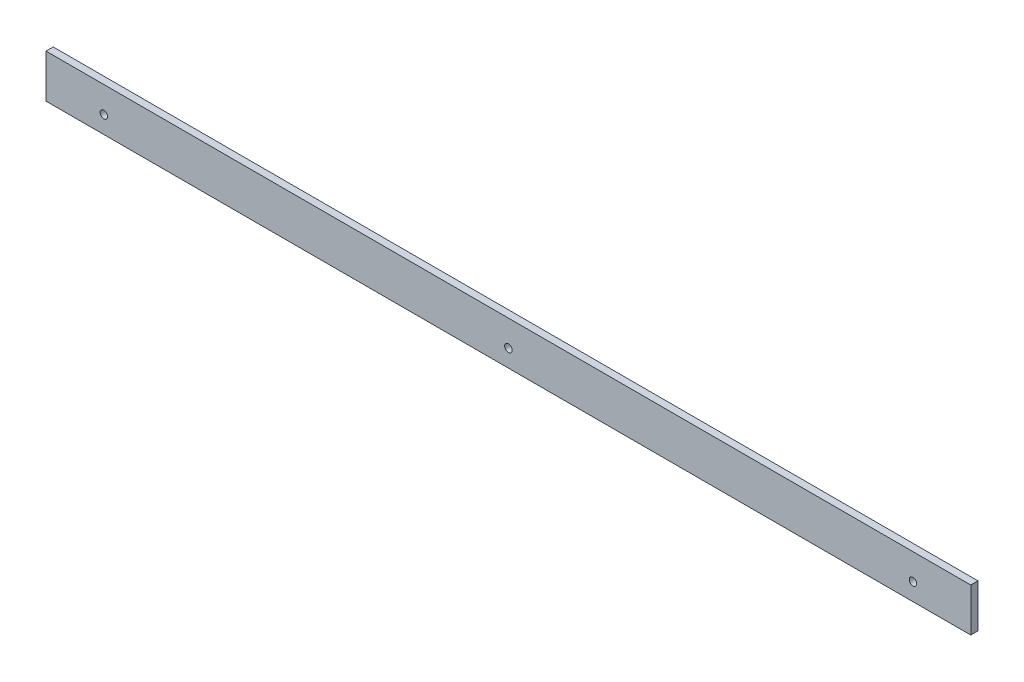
ISO-10303-21;
HEADER;
FILE_DESCRIPTION(('STEP AP214'),'2;1');
FILE_NAME('part.step','',(''),(''),'','','');
FILE_SCHEMA(('AUTOMOTIVE_DESIGN { 1 0 10303 214 1 1 1 1 }'));
ENDSEC;
DATA;
#1=APPLICATION_CONTEXT('core data for automotive mechanical design processes');
#2=APPLICATION_PROTOCOL_DEFINITION('international standard','automotive_design',2000,#1);
#3=PRODUCT_CONTEXT('',#1,'mechanical');
#4=PRODUCT('Part','Part','',(#3));
#5=PRODUCT_RELATED_PRODUCT_CATEGORY('part','',(#4));
#6=PRODUCT_DEFINITION_FORMATION('','',#4);
#7=PRODUCT_DEFINITION_CONTEXT('part definition',#1,'design');
#8=PRODUCT_DEFINITION('design','',#6,#7);
#9=PRODUCT_DEFINITION_SHAPE('','',#8);
#10=(LENGTH_UNIT() NAMED_UNIT(*) SI_UNIT(.MILLI.,.METRE.));
#11=(NAMED_UNIT(*) PLANE_ANGLE_UNIT() SI_UNIT($,.RADIAN.));
#12=(NAMED_UNIT(*) SI_UNIT($,.STERADIAN.) SOLID_ANGLE_UNIT());
#13=UNCERTAINTY_MEASURE_WITH_UNIT(LENGTH_MEASURE(1.E-05),#10,'distance_accuracy_value','');
#14=(GEOMETRIC_REPRESENTATION_CONTEXT(3) GLOBAL_UNCERTAINTY_ASSIGNED_CONTEXT((#13)) GLOBAL_UNIT_ASSIGNED_CONTEXT((#10,
#11,#12)) REPRESENTATION_CONTEXT('',''));
#15=CARTESIAN_POINT('',(0.,0.,0.));
#16=DIRECTION('',(0.,0.,1.));
#17=DIRECTION('',(1.,0.,0.));
#18=AXIS2_PLACEMENT_3D('',#15,#16,#17);
#19=CARTESIAN_POINT('',(-203.2,9.52499999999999,3.175));
#20=DIRECTION('',(1.,0.,0.));
#21=DIRECTION('',(0.,0.,-1.));
#22=AXIS2_PLACEMENT_3D('',#19,#20,#21);
#23=PLANE('',#22);
#24=DIRECTION('',(0.,-1.,0.));
#25=VECTOR('',#24,1.);
#26=CARTESIAN_POINT('',(-203.2,9.52499999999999,0.));
#27=LINE('',#26,#25);
#28=CARTESIAN_POINT('',(-203.2,9.52499999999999,0.));
#29=VERTEX_POINT('',#28);
#30=CARTESIAN_POINT('',(-203.2,-9.52500000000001,0.));
#31=VERTEX_POINT('',#30);
#32=EDGE_CURVE('E98',#29,#31,#27,.T.);
#33=ORIENTED_EDGE('',*,*,#32,.T.);
#34=DIRECTION('',(0.,0.,-1.));
#35=VECTOR('',#34,1.);
#36=CARTESIAN_POINT('',(-203.2,-9.52500000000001,3.175));
#37=LINE('',#36,#35);
#38=CARTESIAN_POINT('',(-203.2,-9.52500000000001,3.175));
#39=VERTEX_POINT('',#38);
#40=EDGE_CURVE('E11',#39,#31,#37,.T.);
#41=ORIENTED_EDGE('',*,*,#40,.F.);
#42=DIRECTION('',(0.,-1.,0.));
#43=VECTOR('',#42,1.);
#44=CARTESIAN_POINT('',(-203.2,9.52499999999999,3.175));
#45=LINE('',#44,#43);
#46=CARTESIAN_POINT('',(-203.2,9.52499999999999,3.175));
#47=VERTEX_POINT('',#46);
#48=EDGE_CURVE('E86',#47,#39,#45,.T.);
#49=ORIENTED_EDGE('',*,*,#48,.F.);
#50=DIRECTION('',(0.,0.,-1.));
#51=VECTOR('',#50,1.);
#52=CARTESIAN_POINT('',(-203.2,9.52499999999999,3.175));
#53=LINE('',#52,#51);
#54=EDGE_CURVE('E94',#47,#29,#53,.T.);
#55=ORIENTED_EDGE('',*,*,#54,.T.);
#56=EDGE_LOOP('',(#33,#41,#49,#55));
#57=FACE_BOUND('',#56,.T.);
#58=ADVANCED_FACE('F35',(#57),#23,.F.);
#59=CARTESIAN_POINT('',(-203.2,-9.52500000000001,3.175));
#60=DIRECTION('',(0.,1.,0.));
#61=DIRECTION('',(0.,0.,1.));
#62=AXIS2_PLACEMENT_3D('',#59,#60,#61);
#63=PLANE('',#62);
#64=DIRECTION('',(1.,0.,0.));
#65=VECTOR('',#64,1.);
#66=CARTESIAN_POINT('',(-203.2,-9.52500000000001,0.));
#67=LINE('',#66,#65);
#68=CARTESIAN_POINT('',(203.2,-9.52500000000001,0.));
#69=VERTEX_POINT('',#68);
#70=EDGE_CURVE('E90',#31,#69,#67,.T.);
#71=ORIENTED_EDGE('',*,*,#70,.T.);
#72=DIRECTION('',(0.,0.,-1.));
#73=VECTOR('',#72,1.);
#74=CARTESIAN_POINT('',(203.2,-9.52500000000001,3.175));
#75=LINE('',#74,#73);
#76=CARTESIAN_POINT('',(203.2,-9.52500000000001,3.175));
#77=VERTEX_POINT('',#76);
#78=EDGE_CURVE('E43',#77,#69,#75,.T.);
#79=ORIENTED_EDGE('',*,*,#78,.F.);
#80=DIRECTION('',(1.,0.,0.));
#81=VECTOR('',#80,1.);
#82=CARTESIAN_POINT('',(-203.2,-9.52500000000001,3.175));
#83=LINE('',#82,#81);
#84=EDGE_CURVE('E81',#39,#77,#83,.T.);
#85=ORIENTED_EDGE('',*,*,#84,.F.);
#86=ORIENTED_EDGE('',*,*,#40,.T.);
#87=EDGE_LOOP('',(#71,#79,#85,#86));
#88=FACE_BOUND('',#87,.T.);
#89=ADVANCED_FACE('F89',(#88),#63,.F.);
#90=CARTESIAN_POINT('',(203.2,9.52499999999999,3.175));
#91=DIRECTION('',(-1.,0.,0.));
#92=DIRECTION('',(0.,0.,1.));
#93=AXIS2_PLACEMENT_3D('',#90,#91,#92);
#94=PLANE('',#93);
#95=DIRECTION('',(0.,1.,0.));
#96=VECTOR('',#95,1.);
#97=CARTESIAN_POINT('',(203.2,9.52499999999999,0.));
#98=LINE('',#97,#96);
#99=CARTESIAN_POINT('',(203.2,9.52499999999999,0.));
#100=VERTEX_POINT('',#99);
#101=EDGE_CURVE('E68',#69,#100,#98,.T.);
#102=ORIENTED_EDGE('',*,*,#101,.T.);
#103=DIRECTION('',(0.,0.,-1.));
#104=VECTOR('',#103,1.);
#105=CARTESIAN_POINT('',(203.2,9.52499999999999,3.175));
#106=LINE('',#105,#104);
#107=CARTESIAN_POINT('',(203.2,9.52499999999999,3.175));
#108=VERTEX_POINT('',#107);
#109=EDGE_CURVE('E91',#108,#100,#106,.T.);
#110=ORIENTED_EDGE('',*,*,#109,.F.);
#111=DIRECTION('',(0.,1.,0.));
#112=VECTOR('',#111,1.);
#113=CARTESIAN_POINT('',(203.2,9.52499999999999,3.175));
#114=LINE('',#113,#112);
#115=EDGE_CURVE('E84',#77,#108,#114,.T.);
#116=ORIENTED_EDGE('',*,*,#115,.F.);
#117=ORIENTED_EDGE('',*,*,#78,.T.);
#118=EDGE_LOOP('',(#102,#110,#116,#117));
#119=FACE_BOUND('',#118,.T.);
#120=ADVANCED_FACE('F92',(#119),#94,.F.);
#121=CARTESIAN_POINT('',(-203.2,9.52499999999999,3.175));
#122=DIRECTION('',(0.,-1.,0.));
#123=DIRECTION('',(0.,0.,-1.));
#124=AXIS2_PLACEMENT_3D('',#121,#122,#123);
#125=PLANE('',#124);
#126=DIRECTION('',(-1.,0.,0.));
#127=VECTOR('',#126,1.);
#128=CARTESIAN_POINT('',(-203.2,9.52499999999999,0.));
#129=LINE('',#128,#127);
#130=EDGE_CURVE('E74',#100,#29,#129,.T.);
#131=ORIENTED_EDGE('',*,*,#130,.T.);
#132=ORIENTED_EDGE('',*,*,#54,.F.);
#133=DIRECTION('',(-1.,0.,0.));
#134=VECTOR('',#133,1.);
#135=CARTESIAN_POINT('',(-203.2,9.52499999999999,3.175));
#136=LINE('',#135,#134);
#137=EDGE_CURVE('E51',#108,#47,#136,.T.);
#138=ORIENTED_EDGE('',*,*,#137,.F.);
#139=ORIENTED_EDGE('',*,*,#109,.T.);
#140=EDGE_LOOP('',(#131,#132,#138,#139));
#141=FACE_BOUND('',#140,.T.);
#142=ADVANCED_FACE('F106',(#141),#125,.F.);
#143=CARTESIAN_POINT('',(0.,0.,3.175));
#144=DIRECTION('',(0.,0.,1.));
#145=DIRECTION('',(1.,0.,0.));
#146=AXIS2_PLACEMENT_3D('',#143,#144,#145);
#147=PLANE('',#146);
#148=CARTESIAN_POINT('',(-177.8,-1.90500000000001,3.175));
#149=DIRECTION('',(0.,0.,1.));
#150=DIRECTION('',(1.,0.,0.));
#151=AXIS2_PLACEMENT_3D('',#148,#149,#150);
#152=CIRCLE('',#151,1.63194999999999);
#153=CARTESIAN_POINT('',(-176.16805,-1.90500000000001,3.175));
#154=VERTEX_POINT('',#153);
#155=EDGE_CURVE('E126',#154,#154,#152,.T.);
#156=ORIENTED_EDGE('',*,*,#155,.F.);
#157=EDGE_LOOP('',(#156));
#158=FACE_BOUND('',#157,.T.);
#159=CARTESIAN_POINT('',(0.,-1.90500000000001,3.175));
#160=DIRECTION('',(0.,0.,1.));
#161=DIRECTION('',(1.,0.,0.));
#162=AXIS2_PLACEMENT_3D('',#159,#160,#161);
#163=CIRCLE('',#162,1.63195);
#164=CARTESIAN_POINT('',(1.63195,-1.90500000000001,3.175));
#165=VERTEX_POINT('',#164);
#166=EDGE_CURVE('E120',#165,#165,#163,.T.);
#167=ORIENTED_EDGE('',*,*,#166,.F.);
#168=EDGE_LOOP('',(#167));
#169=FACE_BOUND('',#168,.T.);
#170=CARTESIAN_POINT('',(177.8,-1.90500000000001,3.175));
#171=DIRECTION('',(0.,0.,1.));
#172=DIRECTION('',(1.,0.,0.));
#173=AXIS2_PLACEMENT_3D('',#170,#171,#172);
#174=CIRCLE('',#173,1.63194999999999);
#175=CARTESIAN_POINT('',(179.43195,-1.90500000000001,3.175));
#176=VERTEX_POINT('',#175);
#177=EDGE_CURVE('E114',#176,#176,#174,.T.);
#178=ORIENTED_EDGE('',*,*,#177,.F.);
#179=EDGE_LOOP('',(#178));
#180=FACE_BOUND('',#179,.T.);
#181=ORIENTED_EDGE('',*,*,#48,.T.);
#182=ORIENTED_EDGE('',*,*,#84,.T.);
#183=ORIENTED_EDGE('',*,*,#115,.T.);
#184=ORIENTED_EDGE('',*,*,#137,.T.);
#185=EDGE_LOOP('',(#181,#182,#183,#184));
#186=FACE_BOUND('',#185,.T.);
#187=ADVANCED_FACE('F82',(#158,#169,#180,#186),#147,.T.);
#188=CARTESIAN_POINT('',(0.,0.,0.));
#189=DIRECTION('',(0.,0.,1.));
#190=DIRECTION('',(1.,0.,0.));
#191=AXIS2_PLACEMENT_3D('',#188,#189,#190);
#192=PLANE('',#191);
#193=CARTESIAN_POINT('',(-177.8,-1.90500000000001,0.));
#194=DIRECTION('',(0.,0.,1.));
#195=DIRECTION('',(1.,0.,0.));
#196=AXIS2_PLACEMENT_3D('',#193,#194,#195);
#197=CIRCLE('',#196,1.63194999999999);
#198=CARTESIAN_POINT('',(-176.16805,-1.90500000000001,0.));
#199=VERTEX_POINT('',#198);
#200=EDGE_CURVE('E123',#199,#199,#197,.T.);
#201=ORIENTED_EDGE('',*,*,#200,.T.);
#202=EDGE_LOOP('',(#201));
#203=FACE_BOUND('',#202,.T.);
#204=CARTESIAN_POINT('',(0.,-1.90500000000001,0.));
#205=DIRECTION('',(0.,0.,1.));
#206=DIRECTION('',(1.,0.,0.));
#207=AXIS2_PLACEMENT_3D('',#204,#205,#206);
#208=CIRCLE('',#207,1.63195);
#209=CARTESIAN_POINT('',(1.63195,-1.90500000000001,0.));
#210=VERTEX_POINT('',#209);
#211=EDGE_CURVE('E117',#210,#210,#208,.T.);
#212=ORIENTED_EDGE('',*,*,#211,.T.);
#213=EDGE_LOOP('',(#212));
#214=FACE_BOUND('',#213,.T.);
#215=CARTESIAN_POINT('',(177.8,-1.90500000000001,0.));
#216=DIRECTION('',(0.,0.,1.));
#217=DIRECTION('',(1.,0.,0.));
#218=AXIS2_PLACEMENT_3D('',#215,#216,#217);
#219=CIRCLE('',#218,1.63194999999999);
#220=CARTESIAN_POINT('',(179.43195,-1.90500000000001,0.));
#221=VERTEX_POINT('',#220);
#222=EDGE_CURVE('E101',#221,#221,#219,.T.);
#223=ORIENTED_EDGE('',*,*,#222,.T.);
#224=EDGE_LOOP('',(#223));
#225=FACE_BOUND('',#224,.T.);
#226=ORIENTED_EDGE('',*,*,#32,.F.);
#227=ORIENTED_EDGE('',*,*,#130,.F.);
#228=ORIENTED_EDGE('',*,*,#101,.F.);
#229=ORIENTED_EDGE('',*,*,#70,.F.);
#230=EDGE_LOOP('',(#226,#227,#228,#229));
#231=FACE_BOUND('',#230,.T.);
#232=ADVANCED_FACE('F109',(#203,#214,#225,#231),#192,.F.);
#233=CARTESIAN_POINT('',(177.8,-1.90500000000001,3.175));
#234=DIRECTION('',(0.,0.,1.));
#235=DIRECTION('',(1.,0.,0.));
#236=AXIS2_PLACEMENT_3D('',#233,#234,#235);
#237=CYLINDRICAL_SURFACE('',#236,1.63194999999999);
#238=ORIENTED_EDGE('',*,*,#222,.F.);
#239=EDGE_LOOP('',(#238));
#240=FACE_BOUND('',#239,.T.);
#241=ORIENTED_EDGE('',*,*,#177,.T.);
#242=EDGE_LOOP('',(#241));
#243=FACE_BOUND('',#242,.T.);
#244=ADVANCED_FACE('F139',(#240,#243),#237,.F.);
#245=CARTESIAN_POINT('',(0.,-1.90500000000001,3.175));
#246=DIRECTION('',(0.,0.,1.));
#247=DIRECTION('',(1.,0.,0.));
#248=AXIS2_PLACEMENT_3D('',#245,#246,#247);
#249=CYLINDRICAL_SURFACE('',#248,1.63195);
#250=ORIENTED_EDGE('',*,*,#211,.F.);
#251=EDGE_LOOP('',(#250));
#252=FACE_BOUND('',#251,.T.);
#253=ORIENTED_EDGE('',*,*,#166,.T.);
#254=EDGE_LOOP('',(#253));
#255=FACE_BOUND('',#254,.T.);
#256=ADVANCED_FACE('F141',(#252,#255),#249,.F.);
#257=CARTESIAN_POINT('',(-177.8,-1.90500000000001,3.175));
#258=DIRECTION('',(0.,0.,1.));
#259=DIRECTION('',(1.,0.,0.));
#260=AXIS2_PLACEMENT_3D('',#257,#258,#259);
#261=CYLINDRICAL_SURFACE('',#260,1.63194999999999);
#262=ORIENTED_EDGE('',*,*,#200,.F.);
#263=EDGE_LOOP('',(#262));
#264=FACE_BOUND('',#263,.T.);
#265=ORIENTED_EDGE('',*,*,#155,.T.);
#266=EDGE_LOOP('',(#265));
#267=FACE_BOUND('',#266,.T.);
#268=ADVANCED_FACE('F130',(#264,#267),#261,.F.);
#269=CLOSED_SHELL('',(#58,#89,#120,#142,#187,#232,#244,#256,#268));
#270=MANIFOLD_SOLID_BREP('B2',#269);
#271=ADVANCED_BREP_SHAPE_REPRESENTATION('',(#18,#270),#14);
#272=SHAPE_DEFINITION_REPRESENTATION(#9,#271);
ENDSEC;
END-ISO-10303-21;
